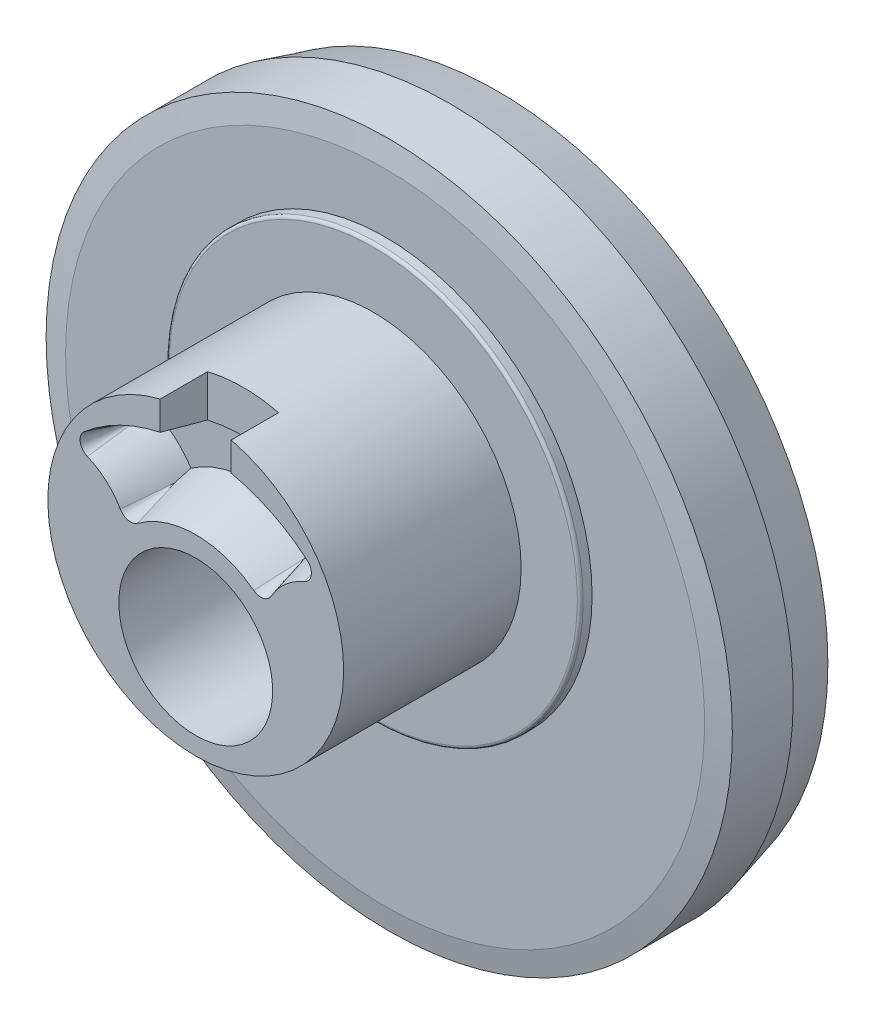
ISO-10303-21;
HEADER;
FILE_DESCRIPTION(('STEP AP214'),'2;1');
FILE_NAME('part.step','',(''),(''),'','','');
FILE_SCHEMA(('AUTOMOTIVE_DESIGN { 1 0 10303 214 1 1 1 1 }'));
ENDSEC;
DATA;
#1=APPLICATION_CONTEXT('core data for automotive mechanical design processes');
#2=APPLICATION_PROTOCOL_DEFINITION('international standard','automotive_design',2000,#1);
#3=PRODUCT_CONTEXT('',#1,'mechanical');
#4=PRODUCT('Part','Part','',(#3));
#5=PRODUCT_RELATED_PRODUCT_CATEGORY('part','',(#4));
#6=PRODUCT_DEFINITION_FORMATION('','',#4);
#7=PRODUCT_DEFINITION_CONTEXT('part definition',#1,'design');
#8=PRODUCT_DEFINITION('design','',#6,#7);
#9=PRODUCT_DEFINITION_SHAPE('','',#8);
#10=(LENGTH_UNIT() NAMED_UNIT(*) SI_UNIT(.MILLI.,.METRE.));
#11=(NAMED_UNIT(*) PLANE_ANGLE_UNIT() SI_UNIT($,.RADIAN.));
#12=(NAMED_UNIT(*) SI_UNIT($,.STERADIAN.) SOLID_ANGLE_UNIT());
#13=UNCERTAINTY_MEASURE_WITH_UNIT(LENGTH_MEASURE(1.E-05),#10,'distance_accuracy_value','');
#14=(GEOMETRIC_REPRESENTATION_CONTEXT(3) GLOBAL_UNCERTAINTY_ASSIGNED_CONTEXT((#13)) GLOBAL_UNIT_ASSIGNED_CONTEXT((#10,
#11,#12)) REPRESENTATION_CONTEXT('',''));
#15=CARTESIAN_POINT('',(0.,0.,0.));
#16=DIRECTION('',(0.,0.,1.));
#17=DIRECTION('',(1.,0.,0.));
#18=AXIS2_PLACEMENT_3D('',#15,#16,#17);
#19=CARTESIAN_POINT('',(0.,4.49999999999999,25.5));
#20=DIRECTION('',(0.,0.,1.));
#21=DIRECTION('',(1.,0.,0.));
#22=AXIS2_PLACEMENT_3D('',#19,#20,#21);
#23=PLANE('',#22);
#24=CARTESIAN_POINT('',(0.,0.,25.5));
#25=DIRECTION('',(0.,0.,-1.));
#26=DIRECTION('',(-1.,0.,0.));
#27=AXIS2_PLACEMENT_3D('',#24,#25,#26);
#28=CIRCLE('',#27,6.5);
#29=CARTESIAN_POINT('',(-6.5,0.,25.5));
#30=VERTEX_POINT('',#29);
#31=EDGE_CURVE('E193',#30,#30,#28,.T.);
#32=ORIENTED_EDGE('',*,*,#31,.T.);
#33=EDGE_LOOP('',(#32));
#34=FACE_BOUND('',#33,.T.);
#35=CARTESIAN_POINT('',(0.,4.49999999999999,25.5));
#36=DIRECTION('',(0.,0.,1.));
#37=DIRECTION('',(1.,0.,0.));
#38=AXIS2_PLACEMENT_3D('',#35,#36,#37);
#39=CIRCLE('',#38,12.5);
#40=CARTESIAN_POINT('',(-3.,16.6346610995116,25.5));
#41=VERTEX_POINT('',#40);
#42=CARTESIAN_POINT('',(3.,16.6346610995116,25.5));
#43=VERTEX_POINT('',#42);
#44=EDGE_CURVE('E191',#41,#43,#39,.T.);
#45=ORIENTED_EDGE('',*,*,#44,.T.);
#46=DIRECTION('',(0.,-1.,0.));
#47=VECTOR('',#46,1.);
#48=CARTESIAN_POINT('',(3.,16.6346610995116,25.5));
#49=LINE('',#48,#47);
#50=CARTESIAN_POINT('',(3.,14.197442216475,25.5));
#51=VERTEX_POINT('',#50);
#52=EDGE_CURVE('E173',#43,#51,#49,.T.);
#53=ORIENTED_EDGE('',*,*,#52,.T.);
#54=CARTESIAN_POINT('',(0.,0.,25.5));
#55=DIRECTION('',(0.,0.,1.));
#56=DIRECTION('',(1.,0.,0.));
#57=AXIS2_PLACEMENT_3D('',#54,#55,#56);
#58=CIRCLE('',#57,14.5109395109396);
#59=CARTESIAN_POINT('',(9.42445258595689,11.0339049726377,25.5));
#60=VERTEX_POINT('',#59);
#61=EDGE_CURVE('E462',#60,#51,#58,.T.);
#62=ORIENTED_EDGE('',*,*,#61,.F.);
#63=CARTESIAN_POINT('',(8.77498033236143,10.2735196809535,25.5));
#64=DIRECTION('',(0.,0.,1.));
#65=DIRECTION('',(-1.,0.,0.));
#66=AXIS2_PLACEMENT_3D('',#63,#64,#65);
#67=CIRCLE('',#66,1.);
#68=CARTESIAN_POINT('',(9.15964616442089,9.35046377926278,25.5));
#69=VERTEX_POINT('',#68);
#70=EDGE_CURVE('E497',#69,#60,#67,.T.);
#71=ORIENTED_EDGE('',*,*,#70,.F.);
#72=CARTESIAN_POINT('',(11.3719776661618,4.04168540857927,25.5));
#73=DIRECTION('',(0.,0.,-1.));
#74=DIRECTION('',(1.,0.,0.));
#75=AXIS2_PLACEMENT_3D('',#72,#73,#74);
#76=CIRCLE('',#75,5.75130754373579);
#77=CARTESIAN_POINT('',(6.37421736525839,6.88772308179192,25.5));
#78=VERTEX_POINT('',#77);
#79=EDGE_CURVE('E477',#78,#69,#76,.T.);
#80=ORIENTED_EDGE('',*,*,#79,.F.);
#81=CARTESIAN_POINT('',(5.50523926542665,7.38257362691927,25.5));
#82=DIRECTION('',(0.,0.,1.));
#83=DIRECTION('',(1.,0.,0.));
#84=AXIS2_PLACEMENT_3D('',#81,#82,#83);
#85=CIRCLE('',#84,1.);
#86=CARTESIAN_POINT('',(4.90744391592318,6.58092487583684,25.5));
#87=VERTEX_POINT('',#86);
#88=EDGE_CURVE('E474',#87,#78,#85,.T.);
#89=ORIENTED_EDGE('',*,*,#88,.F.);
#90=CARTESIAN_POINT('',(0.,0.,25.5));
#91=DIRECTION('',(0.,0.,-1.));
#92=DIRECTION('',(1.,0.,0.));
#93=AXIS2_PLACEMENT_3D('',#90,#91,#92);
#94=CIRCLE('',#93,8.20923735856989);
#95=CARTESIAN_POINT('',(-4.90744391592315,6.58092487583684,25.5));
#96=VERTEX_POINT('',#95);
#97=EDGE_CURVE('E471',#96,#87,#94,.T.);
#98=ORIENTED_EDGE('',*,*,#97,.F.);
#99=CARTESIAN_POINT('',(-5.50523926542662,7.38257362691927,25.5));
#100=DIRECTION('',(0.,0.,1.));
#101=DIRECTION('',(-1.,0.,0.));
#102=AXIS2_PLACEMENT_3D('',#99,#100,#101);
#103=CIRCLE('',#102,1.);
#104=CARTESIAN_POINT('',(-6.37421736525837,6.88772308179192,25.5));
#105=VERTEX_POINT('',#104);
#106=EDGE_CURVE('E464',#105,#96,#103,.T.);
#107=ORIENTED_EDGE('',*,*,#106,.F.);
#108=CARTESIAN_POINT('',(-11.3719776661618,4.04168540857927,25.5));
#109=DIRECTION('',(0.,0.,-1.));
#110=DIRECTION('',(-1.,0.,0.));
#111=AXIS2_PLACEMENT_3D('',#108,#109,#110);
#112=CIRCLE('',#111,5.75130754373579);
#113=CARTESIAN_POINT('',(-9.15964616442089,9.35046377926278,25.5));
#114=VERTEX_POINT('',#113);
#115=EDGE_CURVE('E461',#114,#105,#112,.T.);
#116=ORIENTED_EDGE('',*,*,#115,.F.);
#117=CARTESIAN_POINT('',(-8.77498033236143,10.2735196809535,25.5));
#118=DIRECTION('',(0.,0.,1.));
#119=DIRECTION('',(1.,0.,0.));
#120=AXIS2_PLACEMENT_3D('',#117,#118,#119);
#121=CIRCLE('',#120,1.);
#122=CARTESIAN_POINT('',(-9.42445258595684,11.0339049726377,25.5));
#123=VERTEX_POINT('',#122);
#124=EDGE_CURVE('E456',#123,#114,#121,.T.);
#125=ORIENTED_EDGE('',*,*,#124,.F.);
#126=CARTESIAN_POINT('',(-2.99999999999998,14.197442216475,25.5));
#127=VERTEX_POINT('',#126);
#128=EDGE_CURVE('E459',#127,#123,#58,.T.);
#129=ORIENTED_EDGE('',*,*,#128,.F.);
#130=DIRECTION('',(0.,1.,0.));
#131=VECTOR('',#130,1.);
#132=CARTESIAN_POINT('',(-3.,16.6346610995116,25.5));
#133=LINE('',#132,#131);
#134=EDGE_CURVE('E185',#127,#41,#133,.T.);
#135=ORIENTED_EDGE('',*,*,#134,.T.);
#136=EDGE_LOOP('',(#45,#53,#62,#71,#80,#89,#98,#107,#116,#125,#129,#135));
#137=FACE_BOUND('',#136,.T.);
#138=ADVANCED_FACE('F35',(#34,#137),#23,.T.);
#139=CARTESIAN_POINT('',(0.,4.49999999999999,25.5));
#140=DIRECTION('',(0.,0.,-1.));
#141=DIRECTION('',(-1.,0.,0.));
#142=AXIS2_PLACEMENT_3D('',#139,#140,#141);
#143=CYLINDRICAL_SURFACE('',#142,12.5);
#144=CARTESIAN_POINT('',(0.,4.49999999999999,10.5));
#145=DIRECTION('',(0.,0.,1.));
#146=DIRECTION('',(1.,0.,0.));
#147=AXIS2_PLACEMENT_3D('',#144,#145,#146);
#148=CIRCLE('',#147,12.5);
#149=CARTESIAN_POINT('',(12.5,4.49999999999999,10.5));
#150=VERTEX_POINT('',#149);
#151=EDGE_CURVE('E199',#150,#150,#148,.T.);
#152=ORIENTED_EDGE('',*,*,#151,.T.);
#153=EDGE_LOOP('',(#152));
#154=FACE_BOUND('',#153,.T.);
#155=DIRECTION('',(0.,0.,1.));
#156=VECTOR('',#155,1.);
#157=CARTESIAN_POINT('',(3.,16.6346610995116,21.5));
#158=LINE('',#157,#156);
#159=CARTESIAN_POINT('',(3.,16.6346610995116,21.5));
#160=VERTEX_POINT('',#159);
#161=EDGE_CURVE('E177',#160,#43,#158,.T.);
#162=ORIENTED_EDGE('',*,*,#161,.T.);
#163=ORIENTED_EDGE('',*,*,#44,.F.);
#164=DIRECTION('',(0.,0.,1.));
#165=VECTOR('',#164,1.);
#166=CARTESIAN_POINT('',(-3.,16.6346610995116,21.5));
#167=LINE('',#166,#165);
#168=CARTESIAN_POINT('',(-3.,16.6346610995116,21.5));
#169=VERTEX_POINT('',#168);
#170=EDGE_CURVE('E194',#169,#41,#167,.T.);
#171=ORIENTED_EDGE('',*,*,#170,.F.);
#172=CARTESIAN_POINT('',(0.,4.49999999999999,21.5));
#173=DIRECTION('',(0.,0.,-1.));
#174=DIRECTION('',(-1.,0.,0.));
#175=AXIS2_PLACEMENT_3D('',#172,#173,#174);
#176=CIRCLE('',#175,12.5);
#177=EDGE_CURVE('E192',#169,#160,#176,.T.);
#178=ORIENTED_EDGE('',*,*,#177,.T.);
#179=EDGE_LOOP('',(#162,#163,#171,#178));
#180=FACE_BOUND('',#179,.T.);
#181=ADVANCED_FACE('F189',(#154,#180),#143,.T.);
#182=CARTESIAN_POINT('',(0.,0.,25.5));
#183=DIRECTION('',(0.,0.,1.));
#184=DIRECTION('',(1.,0.,0.));
#185=AXIS2_PLACEMENT_3D('',#182,#183,#184);
#186=CONICAL_SURFACE('',#185,14.5109395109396,0.26179938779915);
#187=CARTESIAN_POINT('',(3.,10.9218173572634,13.614932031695));
#188=CARTESIAN_POINT('',(3.,11.3100454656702,15.012224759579));
#189=CARTESIAN_POINT('',(3.,11.6970071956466,16.4098684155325));
#190=CARTESIAN_POINT('',(3.,12.4689162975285,19.2057100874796));
#191=CARTESIAN_POINT('',(3.,12.853863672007,20.6039081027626));
#192=CARTESIAN_POINT('',(3.,13.6222632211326,23.400713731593));
#193=CARTESIAN_POINT('',(3.00000000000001,14.0057153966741,24.7993213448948));
#194=CARTESIAN_POINT('',(3.,14.7714281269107,27.5968646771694));
#195=CARTESIAN_POINT('',(2.99999999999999,15.1536886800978,28.9958003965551));
#196=CARTESIAN_POINT('',(2.99999999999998,15.5355046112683,30.3948572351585));
#197=B_SPLINE_CURVE_WITH_KNOTS('',3,(#187,#188,#189,#190,#191,#192,#193,#194,#195,#196),
.UNSPECIFIED.,.F.,.F.,(4,2,2,2,4),(0.,4.35066845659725,8.70133135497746,13.0519916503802,
17.4026574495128),.UNSPECIFIED.);
#198=CARTESIAN_POINT('',(3.,13.1000212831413,21.5));
#199=VERTEX_POINT('',#198);
#200=EDGE_CURVE('E180',#199,#51,#197,.T.);
#201=ORIENTED_EDGE('',*,*,#200,.F.);
#202=CARTESIAN_POINT('',(0.,0.,21.5));
#203=DIRECTION('',(0.,0.,-1.));
#204=DIRECTION('',(-1.,0.,0.));
#205=AXIS2_PLACEMENT_3D('',#202,#203,#204);
#206=CIRCLE('',#205,13.4391427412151);
#207=CARTESIAN_POINT('',(-3.,13.1000212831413,21.5));
#208=VERTEX_POINT('',#207);
#209=EDGE_CURVE('E221',#199,#208,#206,.F.);
#210=ORIENTED_EDGE('',*,*,#209,.T.);
#211=CARTESIAN_POINT('',(-3.,15.5355046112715,30.3948572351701));
#212=CARTESIAN_POINT('',(-3.,15.1536886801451,28.9958003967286));
#213=CARTESIAN_POINT('',(-3.,14.7714281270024,27.5968646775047));
#214=CARTESIAN_POINT('',(-3.,14.0057153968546,24.7993213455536));
#215=CARTESIAN_POINT('',(-3.,13.6222632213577,23.4007137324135));
#216=CARTESIAN_POINT('',(-3.,12.853863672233,20.6039081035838));
#217=CARTESIAN_POINT('',(-3.,12.4689162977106,19.2057100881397));
#218=CARTESIAN_POINT('',(-3.00000000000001,11.6970071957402,16.4098684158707));
#219=CARTESIAN_POINT('',(-3.00000000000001,11.3100454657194,15.0122247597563));
#220=CARTESIAN_POINT('',(-3.,10.921817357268,13.6149320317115));
#221=B_SPLINE_CURVE_WITH_KNOTS('',3,(#211,#212,#213,#214,#215,#216,#217,#218,#219,#220),
.UNSPECIFIED.,.F.,.F.,(4,2,2,2,4),(0.,4.35066579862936,8.70132609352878,13.0519889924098,
17.4026574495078),.UNSPECIFIED.);
#222=EDGE_CURVE('E228',#127,#208,#221,.T.);
#223=ORIENTED_EDGE('',*,*,#222,.F.);
#224=ORIENTED_EDGE('',*,*,#128,.T.);
#225=DIRECTION('',(-0.168095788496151,0.196802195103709,0.965925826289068));
#226=VECTOR('',#225,1.);
#227=CARTESIAN_POINT('',(-8.77498033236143,10.2735196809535,21.7679491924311));
#228=LINE('',#227,#226);
#229=CARTESIAN_POINT('',(-8.77498033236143,10.2735196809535,21.7679491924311));
#230=VERTEX_POINT('',#229);
#231=EDGE_CURVE('E311',#230,#123,#228,.T.);
#232=ORIENTED_EDGE('',*,*,#231,.F.);
#233=CARTESIAN_POINT('',(-8.14105916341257,10.3539120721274,20.5));
#234=CARTESIAN_POINT('',(-8.27822543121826,10.3406052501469,20.7773990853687));
#235=CARTESIAN_POINT('',(-8.41611116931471,10.3246391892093,21.0543255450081));
#236=CARTESIAN_POINT('',(-8.69338744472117,10.2869591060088,21.6070514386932));
#237=CARTESIAN_POINT('',(-8.83277807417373,10.2652447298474,21.8828508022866));
#238=CARTESIAN_POINT('',(-9.11273446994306,10.2157070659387,22.4323632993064));
#239=CARTESIAN_POINT('',(-9.25329604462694,10.187900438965,22.7060800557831));
#240=CARTESIAN_POINT('',(-9.53602899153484,10.1256112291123,23.2519156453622));
#241=CARTESIAN_POINT('',(-9.67820033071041,10.0911287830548,23.5240345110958));
#242=CARTESIAN_POINT('',(-9.96439267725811,10.0148016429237,24.0666658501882));
#243=CARTESIAN_POINT('',(-10.1084155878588,9.97294869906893,24.3371761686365));
#244=CARTESIAN_POINT('',(-10.3982239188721,9.88111598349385,24.8758386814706));
#245=CARTESIAN_POINT('',(-10.5440091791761,9.83113694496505,25.1439910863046));
#246=CARTESIAN_POINT('',(-10.8378447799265,9.72191212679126,25.6781418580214));
#247=CARTESIAN_POINT('',(-10.9859001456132,9.66264185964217,25.9441325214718));
#248=CARTESIAN_POINT('',(-11.2094770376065,9.56589834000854,26.3404125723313));
#249=CARTESIAN_POINT('',(-11.2842644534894,9.53233778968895,26.4720770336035));
#250=CARTESIAN_POINT('',(-11.4343477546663,9.46240155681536,26.7343753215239));
#251=CARTESIAN_POINT('',(-11.5096436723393,9.42602569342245,26.8650090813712));
#252=CARTESIAN_POINT('',(-11.5851983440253,9.38814216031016,26.9950624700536));
#253=B_SPLINE_CURVE_WITH_KNOTS('',3,(#233,#234,#235,#236,#237,#238,#239,#240,#241,#242,#243,
#244,#245,#246,#247,#248,#249,#250,#251,#252),.UNSPECIFIED.,.F.,.F.,(4,2,2,2,2,2,2,2,2,4),(0.,
0.929236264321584,1.85852975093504,2.78531288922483,3.71207703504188,4.63988517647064,
5.56760965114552,6.49782162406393,6.96308546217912,7.42837921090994),.UNSPECIFIED.);
#254=CARTESIAN_POINT('',(-8.14105916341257,10.3539120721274,20.5));
#255=VERTEX_POINT('',#254);
#256=EDGE_CURVE('E313',#255,#230,#253,.T.);
#257=ORIENTED_EDGE('',*,*,#256,.F.);
#258=CARTESIAN_POINT('',(0.,0.,20.5));
#259=DIRECTION('',(0.,0.,-1.));
#260=DIRECTION('',(-1.,0.,0.));
#261=AXIS2_PLACEMENT_3D('',#258,#259,#260);
#262=CIRCLE('',#261,13.171193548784);
#263=CARTESIAN_POINT('',(8.14105916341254,10.3539120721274,20.5));
#264=VERTEX_POINT('',#263);
#265=EDGE_CURVE('E480',#264,#255,#262,.F.);
#266=ORIENTED_EDGE('',*,*,#265,.F.);
#267=CARTESIAN_POINT('',(8.14105916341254,10.3539120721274,20.5));
#268=CARTESIAN_POINT('',(8.19345831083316,10.348833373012,20.6059732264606));
#269=CARTESIAN_POINT('',(8.24596278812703,10.3433633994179,20.7118757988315));
#270=CARTESIAN_POINT('',(8.35118241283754,10.331620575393,20.9235245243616));
#271=CARTESIAN_POINT('',(8.4038975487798,10.3253477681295,21.0292706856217));
#272=CARTESIAN_POINT('',(8.50954428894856,10.311978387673,21.2406031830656));
#273=CARTESIAN_POINT('',(8.56247589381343,10.304881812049,21.3461895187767));
#274=CARTESIAN_POINT('',(8.66856135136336,10.2898416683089,21.5571971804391));
#275=CARTESIAN_POINT('',(8.72171521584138,10.2818980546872,21.6626184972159));
#276=CARTESIAN_POINT('',(8.77498033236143,10.2735196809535,21.7679491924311));
#277=B_SPLINE_CURVE_WITH_KNOTS('',3,(#267,#268,#269,#270,#271,#272,#273,#274,#275,#276),
.UNSPECIFIED.,.F.,.F.,(4,2,2,2,4),(0.,0.354986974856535,0.709954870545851,1.06492381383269,
1.41991183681),.UNSPECIFIED.);
#278=CARTESIAN_POINT('',(8.77498033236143,10.2735196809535,21.7679491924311));
#279=VERTEX_POINT('',#278);
#280=EDGE_CURVE('E276',#264,#279,#277,.T.);
#281=ORIENTED_EDGE('',*,*,#280,.T.);
#282=DIRECTION('',(0.168095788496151,0.196802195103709,0.965925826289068));
#283=VECTOR('',#282,1.);
#284=CARTESIAN_POINT('',(8.77498033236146,10.2735196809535,21.7679491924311));
#285=LINE('',#284,#283);
#286=EDGE_CURVE('E314',#279,#60,#285,.T.);
#287=ORIENTED_EDGE('',*,*,#286,.T.);
#288=ORIENTED_EDGE('',*,*,#61,.T.);
#289=EDGE_LOOP('',(#201,#210,#223,#224,#232,#257,#266,#281,#287,#288));
#290=FACE_BOUND('',#289,.T.);
#291=ADVANCED_FACE('F239',(#290),#186,.F.);
#292=CARTESIAN_POINT('',(-12.,0.,0.));
#293=DIRECTION('',(0.,-0.939692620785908,0.342020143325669));
#294=DIRECTION('',(0.,-0.342020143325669,-0.939692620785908));
#295=AXIS2_PLACEMENT_3D('',#292,#293,#294);
#296=PLANE('',#295);
#297=CARTESIAN_POINT('',(0.,18.2106303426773,50.0332956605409));
#298=DIRECTION('',(0.,-0.939692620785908,0.342020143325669));
#299=DIRECTION('',(0.,0.342020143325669,0.939692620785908));
#300=AXIS2_PLACEMENT_3D('',#297,#298,#299);
#301=ELLIPSE('',#300,72.3247114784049,16.7412000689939);
#302=CARTESIAN_POINT('',(-11.7193408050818,0.545955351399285,1.5));
#303=VERTEX_POINT('',#302);
#304=CARTESIAN_POINT('',(-11.9654517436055,0.909925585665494,2.5));
#305=VERTEX_POINT('',#304);
#306=EDGE_CURVE('E58',#303,#305,#301,.F.);
#307=ORIENTED_EDGE('',*,*,#306,.F.);
#308=DIRECTION('',(1.,0.,0.));
#309=VECTOR('',#308,1.);
#310=CARTESIAN_POINT('',(-12.,0.545955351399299,1.5));
#311=LINE('',#310,#309);
#312=CARTESIAN_POINT('',(-11.4410258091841,0.545955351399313,1.5));
#313=VERTEX_POINT('',#312);
#314=EDGE_CURVE('E498',#303,#313,#311,.T.);
#315=ORIENTED_EDGE('',*,*,#314,.T.);
#316=CARTESIAN_POINT('',(-11.052682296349,0.909925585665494,2.5));
#317=CARTESIAN_POINT('',(-11.1346090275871,0.834465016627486,2.29267379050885));
#318=CARTESIAN_POINT('',(-11.2157376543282,0.758903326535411,2.08506975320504));
#319=CARTESIAN_POINT('',(-11.3764754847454,0.607594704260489,1.6693527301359));
#320=CARTESIAN_POINT('',(-11.4560847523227,0.531847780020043,1.46123976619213));
#321=CARTESIAN_POINT('',(-11.6138671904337,0.380179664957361,1.04453504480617));
#322=CARTESIAN_POINT('',(-11.6920403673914,0.304258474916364,0.835943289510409));
#323=CARTESIAN_POINT('',(-11.8470248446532,0.152250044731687,0.418303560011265));
#324=CARTESIAN_POINT('',(-11.9238360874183,0.0761627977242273,0.209255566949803));
#325=CARTESIAN_POINT('',(-12.,0.,0.));
#326=B_SPLINE_CURVE_WITH_KNOTS('',3,(#316,#317,#318,#319,#320,#321,#322,#323,#324,#325),
.UNSPECIFIED.,.F.,.F.,(4,2,2,2,4),(0.,0.706052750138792,1.41207573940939,2.118095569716,
2.82414515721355),.UNSPECIFIED.);
#327=CARTESIAN_POINT('',(-12.,0.,0.));
#328=VERTEX_POINT('',#327);
#329=EDGE_CURVE('E353',#313,#328,#326,.T.);
#330=ORIENTED_EDGE('',*,*,#329,.T.);
#331=DIRECTION('',(-1.,0.,0.));
#332=VECTOR('',#331,1.);
#333=CARTESIAN_POINT('',(-12.,0.,0.));
#334=LINE('',#333,#332);
#335=CARTESIAN_POINT('',(-24.5564648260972,0.,0.));
#336=VERTEX_POINT('',#335);
#337=EDGE_CURVE('E347',#328,#336,#334,.T.);
#338=ORIENTED_EDGE('',*,*,#337,.T.);
#339=DIRECTION('',(0.,-0.342020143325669,-0.939692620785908));
#340=VECTOR('',#339,1.);
#341=CARTESIAN_POINT('',(-24.5564648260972,0.,0.));
#342=LINE('',#341,#340);
#343=CARTESIAN_POINT('',(-24.5564648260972,0.909925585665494,2.5));
#344=VERTEX_POINT('',#343);
#345=EDGE_CURVE('E351',#344,#336,#342,.T.);
#346=ORIENTED_EDGE('',*,*,#345,.F.);
#347=DIRECTION('',(-1.,0.,0.));
#348=VECTOR('',#347,1.);
#349=CARTESIAN_POINT('',(-24.5564648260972,0.909925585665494,2.5));
#350=LINE('',#349,#348);
#351=EDGE_CURVE('E358',#305,#344,#350,.T.);
#352=ORIENTED_EDGE('',*,*,#351,.F.);
#353=EDGE_LOOP('',(#307,#315,#330,#338,#346,#352));
#354=FACE_BOUND('',#353,.T.);
#355=ADVANCED_FACE('F381',(#354),#296,.F.);
#356=CARTESIAN_POINT('',(24.5564648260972,0.,0.));
#357=DIRECTION('',(0.,-0.939692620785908,0.342020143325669));
#358=DIRECTION('',(0.,-0.342020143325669,-0.939692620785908));
#359=AXIS2_PLACEMENT_3D('',#356,#357,#358);
#360=PLANE('',#359);
#361=CARTESIAN_POINT('',(0.,18.2106303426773,50.0332956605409));
#362=DIRECTION('',(0.,-0.939692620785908,0.342020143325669));
#363=DIRECTION('',(0.,0.342020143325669,0.939692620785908));
#364=AXIS2_PLACEMENT_3D('',#361,#362,#363);
#365=ELLIPSE('',#364,72.3247114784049,16.7412000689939);
#366=CARTESIAN_POINT('',(11.9654517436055,0.909925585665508,2.5));
#367=VERTEX_POINT('',#366);
#368=CARTESIAN_POINT('',(11.7193408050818,0.545955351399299,1.5));
#369=VERTEX_POINT('',#368);
#370=EDGE_CURVE('E506',#367,#369,#365,.F.);
#371=ORIENTED_EDGE('',*,*,#370,.F.);
#372=DIRECTION('',(-1.,0.,0.));
#373=VECTOR('',#372,1.);
#374=CARTESIAN_POINT('',(-24.5564648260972,0.909925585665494,2.5));
#375=LINE('',#374,#373);
#376=CARTESIAN_POINT('',(24.5564648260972,0.909925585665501,2.5));
#377=VERTEX_POINT('',#376);
#378=EDGE_CURVE('E552',#377,#367,#375,.T.);
#379=ORIENTED_EDGE('',*,*,#378,.F.);
#380=DIRECTION('',(0.,-0.342020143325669,-0.939692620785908));
#381=VECTOR('',#380,1.);
#382=CARTESIAN_POINT('',(24.5564648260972,0.,0.));
#383=LINE('',#382,#381);
#384=CARTESIAN_POINT('',(24.5564648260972,0.,0.));
#385=VERTEX_POINT('',#384);
#386=EDGE_CURVE('E360',#377,#385,#383,.T.);
#387=ORIENTED_EDGE('',*,*,#386,.T.);
#388=DIRECTION('',(-1.,0.,0.));
#389=VECTOR('',#388,1.);
#390=CARTESIAN_POINT('',(24.5564648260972,0.,0.));
#391=LINE('',#390,#389);
#392=CARTESIAN_POINT('',(12.,0.,0.));
#393=VERTEX_POINT('',#392);
#394=EDGE_CURVE('E341',#385,#393,#391,.T.);
#395=ORIENTED_EDGE('',*,*,#394,.T.);
#396=CARTESIAN_POINT('',(11.0526822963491,0.909925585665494,2.5));
#397=CARTESIAN_POINT('',(11.1346090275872,0.834465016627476,2.29267379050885));
#398=CARTESIAN_POINT('',(11.2157376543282,0.758903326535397,2.08506975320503));
#399=CARTESIAN_POINT('',(11.3764754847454,0.607594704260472,1.66935273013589));
#400=CARTESIAN_POINT('',(11.4560847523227,0.531847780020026,1.46123976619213));
#401=CARTESIAN_POINT('',(11.6138671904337,0.380179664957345,1.04453504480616));
#402=CARTESIAN_POINT('',(11.6920403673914,0.304258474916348,0.835943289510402));
#403=CARTESIAN_POINT('',(11.8470248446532,0.152250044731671,0.418303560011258));
#404=CARTESIAN_POINT('',(11.9238360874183,0.0761627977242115,0.209255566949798));
#405=CARTESIAN_POINT('',(12.,0.,0.));
#406=B_SPLINE_CURVE_WITH_KNOTS('',3,(#396,#397,#398,#399,#400,#401,#402,#403,#404,#405),
.UNSPECIFIED.,.F.,.F.,(4,2,2,2,4),(0.,0.706052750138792,1.41207573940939,2.118095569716,
2.82414515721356),.UNSPECIFIED.);
#407=CARTESIAN_POINT('',(11.4410258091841,0.545955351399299,1.5));
#408=VERTEX_POINT('',#407);
#409=EDGE_CURVE('E362',#408,#393,#406,.T.);
#410=ORIENTED_EDGE('',*,*,#409,.F.);
#411=DIRECTION('',(1.,0.,0.));
#412=VECTOR('',#411,1.);
#413=CARTESIAN_POINT('',(24.5564648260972,0.545955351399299,1.5));
#414=LINE('',#413,#412);
#415=EDGE_CURVE('E218',#408,#369,#414,.T.);
#416=ORIENTED_EDGE('',*,*,#415,.T.);
#417=EDGE_LOOP('',(#371,#379,#387,#395,#410,#416));
#418=FACE_BOUND('',#417,.T.);
#419=ADVANCED_FACE('F377',(#418),#360,.F.);
#420=CARTESIAN_POINT('',(-24.5564648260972,0.999999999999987,2.5));
#421=DIRECTION('',(0.,0.,-1.));
#422=DIRECTION('',(-1.,0.,0.));
#423=AXIS2_PLACEMENT_3D('',#420,#421,#422);
#424=PLANE('',#423);
#425=ORIENTED_EDGE('',*,*,#378,.T.);
#426=CARTESIAN_POINT('',(0.,0.,2.5));
#427=DIRECTION('',(0.,0.,-1.));
#428=DIRECTION('',(-1.,0.,0.));
#429=AXIS2_PLACEMENT_3D('',#426,#427,#428);
#430=CIRCLE('',#429,12.);
#431=EDGE_CURVE('E225',#305,#367,#430,.T.);
#432=ORIENTED_EDGE('',*,*,#431,.F.);
#433=ORIENTED_EDGE('',*,*,#351,.T.);
#434=CARTESIAN_POINT('',(-24.5564648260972,0.999999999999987,2.5));
#435=DIRECTION('',(0.,0.,-1.));
#436=DIRECTION('',(-1.,0.,0.));
#437=AXIS2_PLACEMENT_3D('',#434,#435,#436);
#438=CIRCLE('',#437,0.0900744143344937);
#439=CARTESIAN_POINT('',(-24.6464646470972,1.00366501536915,2.5));
#440=VERTEX_POINT('',#439);
#441=EDGE_CURVE('E350',#344,#440,#438,.T.);
#442=ORIENTED_EDGE('',*,*,#441,.T.);
#443=CARTESIAN_POINT('',(0.,0.,2.5));
#444=DIRECTION('',(0.,0.,-1.));
#445=DIRECTION('',(-1.,0.,0.));
#446=AXIS2_PLACEMENT_3D('',#443,#444,#445);
#447=CIRCLE('',#446,24.6668920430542);
#448=CARTESIAN_POINT('',(24.6464646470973,1.00366501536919,2.5));
#449=VERTEX_POINT('',#448);
#450=EDGE_CURVE('E540',#440,#449,#447,.T.);
#451=ORIENTED_EDGE('',*,*,#450,.T.);
#452=CARTESIAN_POINT('',(24.5564648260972,0.999999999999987,2.5));
#453=DIRECTION('',(0.,0.,-1.));
#454=DIRECTION('',(-1.,0.,0.));
#455=AXIS2_PLACEMENT_3D('',#452,#453,#454);
#456=CIRCLE('',#455,0.0900744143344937);
#457=EDGE_CURVE('E554',#449,#377,#456,.T.);
#458=ORIENTED_EDGE('',*,*,#457,.T.);
#459=EDGE_LOOP('',(#425,#432,#433,#442,#451,#458));
#460=FACE_BOUND('',#459,.T.);
#461=ADVANCED_FACE('F380',(#460),#424,.T.);
#462=CARTESIAN_POINT('',(0.,0.,9.5));
#463=DIRECTION('',(0.,0.,1.));
#464=DIRECTION('',(1.,0.,0.));
#465=AXIS2_PLACEMENT_3D('',#462,#463,#464);
#466=PLANE('',#465);
#467=CARTESIAN_POINT('',(0.,0.,9.5));
#468=DIRECTION('',(0.,0.,1.));
#469=DIRECTION('',(1.,0.,0.));
#470=AXIS2_PLACEMENT_3D('',#467,#468,#469);
#471=CIRCLE('',#470,27.);
#472=CARTESIAN_POINT('',(-27.,0.,9.5));
#473=VERTEX_POINT('',#472);
#474=EDGE_CURVE('E212',#473,#473,#471,.T.);
#475=ORIENTED_EDGE('',*,*,#474,.T.);
#476=EDGE_LOOP('',(#475));
#477=FACE_BOUND('',#476,.T.);
#478=CARTESIAN_POINT('',(0.,4.49999999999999,9.5));
#479=DIRECTION('',(0.,0.,1.));
#480=DIRECTION('',(1.,0.,0.));
#481=AXIS2_PLACEMENT_3D('',#478,#479,#480);
#482=CIRCLE('',#481,17.5);
#483=CARTESIAN_POINT('',(17.5,4.49999999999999,9.5));
#484=VERTEX_POINT('',#483);
#485=EDGE_CURVE('E205',#484,#484,#482,.T.);
#486=ORIENTED_EDGE('',*,*,#485,.F.);
#487=EDGE_LOOP('',(#486));
#488=FACE_BOUND('',#487,.T.);
#489=ADVANCED_FACE('F421',(#477,#488),#466,.T.);
#490=CARTESIAN_POINT('',(0.,0.,9.5));
#491=DIRECTION('',(0.,0.,-1.));
#492=DIRECTION('',(-1.,0.,0.));
#493=AXIS2_PLACEMENT_3D('',#490,#491,#492);
#494=CYLINDRICAL_SURFACE('',#493,29.);
#495=CARTESIAN_POINT('',(0.,0.,4.00000000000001));
#496=DIRECTION('',(0.,0.,1.));
#497=DIRECTION('',(1.,0.,0.));
#498=AXIS2_PLACEMENT_3D('',#495,#496,#497);
#499=CIRCLE('',#498,29.);
#500=CARTESIAN_POINT('',(29.,0.,4.00000000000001));
#501=VERTEX_POINT('',#500);
#502=EDGE_CURVE('E43',#501,#501,#499,.T.);
#503=ORIENTED_EDGE('',*,*,#502,.T.);
#504=EDGE_LOOP('',(#503));
#505=FACE_BOUND('',#504,.T.);
#506=CARTESIAN_POINT('',(0.,0.,9.14734603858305));
#507=DIRECTION('',(0.,0.,1.));
#508=DIRECTION('',(1.,0.,0.));
#509=AXIS2_PLACEMENT_3D('',#506,#507,#508);
#510=CIRCLE('',#509,29.);
#511=CARTESIAN_POINT('',(-29.,0.,9.14734603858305));
#512=VERTEX_POINT('',#511);
#513=EDGE_CURVE('E215',#512,#512,#510,.F.);
#514=ORIENTED_EDGE('',*,*,#513,.T.);
#515=EDGE_LOOP('',(#514));
#516=FACE_BOUND('',#515,.T.);
#517=ADVANCED_FACE('F37',(#505,#516),#494,.T.);
#518=CARTESIAN_POINT('',(0.,0.,0.));
#519=DIRECTION('',(0.,0.,1.));
#520=DIRECTION('',(1.,0.,0.));
#521=AXIS2_PLACEMENT_3D('',#518,#519,#520);
#522=PLANE('',#521);
#523=CARTESIAN_POINT('',(0.,0.,0.));
#524=DIRECTION('',(0.,0.,1.));
#525=DIRECTION('',(1.,0.,0.));
#526=AXIS2_PLACEMENT_3D('',#523,#524,#525);
#527=CIRCLE('',#526,27.9282032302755);
#528=CARTESIAN_POINT('',(27.9282032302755,0.,0.));
#529=VERTEX_POINT('',#528);
#530=EDGE_CURVE('E11',#529,#529,#527,.F.);
#531=ORIENTED_EDGE('',*,*,#530,.T.);
#532=EDGE_LOOP('',(#531));
#533=FACE_BOUND('',#532,.T.);
#534=CARTESIAN_POINT('',(0.,0.,0.));
#535=DIRECTION('',(0.,0.,-1.));
#536=DIRECTION('',(1.,0.,0.));
#537=AXIS2_PLACEMENT_3D('',#534,#535,#536);
#538=CIRCLE('',#537,25.5768176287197);
#539=CARTESIAN_POINT('',(-25.5556366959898,1.04068875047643,0.));
#540=VERTEX_POINT('',#539);
#541=CARTESIAN_POINT('',(25.5556366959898,1.04068875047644,0.));
#542=VERTEX_POINT('',#541);
#543=EDGE_CURVE('E335',#540,#542,#538,.T.);
#544=ORIENTED_EDGE('',*,*,#543,.F.);
#545=CARTESIAN_POINT('',(-24.5564648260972,0.999999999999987,0.));
#546=DIRECTION('',(0.,0.,-1.));
#547=DIRECTION('',(-1.,0.,0.));
#548=AXIS2_PLACEMENT_3D('',#545,#546,#547);
#549=CIRCLE('',#548,1.);
#550=EDGE_CURVE('E333',#336,#540,#549,.T.);
#551=ORIENTED_EDGE('',*,*,#550,.F.);
#552=ORIENTED_EDGE('',*,*,#337,.F.);
#553=CARTESIAN_POINT('',(0.,0.,0.));
#554=DIRECTION('',(0.,0.,-1.));
#555=DIRECTION('',(-1.,0.,0.));
#556=AXIS2_PLACEMENT_3D('',#553,#554,#555);
#557=CIRCLE('',#556,12.);
#558=EDGE_CURVE('E344',#393,#328,#557,.T.);
#559=ORIENTED_EDGE('',*,*,#558,.F.);
#560=ORIENTED_EDGE('',*,*,#394,.F.);
#561=CARTESIAN_POINT('',(24.5564648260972,0.999999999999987,0.));
#562=DIRECTION('',(0.,0.,-1.));
#563=DIRECTION('',(1.,0.,0.));
#564=AXIS2_PLACEMENT_3D('',#561,#562,#563);
#565=CIRCLE('',#564,1.);
#566=EDGE_CURVE('E338',#542,#385,#565,.T.);
#567=ORIENTED_EDGE('',*,*,#566,.F.);
#568=EDGE_LOOP('',(#544,#551,#552,#559,#560,#567));
#569=FACE_BOUND('',#568,.T.);
#570=ADVANCED_FACE('F408',(#533,#569),#522,.F.);
#571=CARTESIAN_POINT('',(0.,4.49999999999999,10.5));
#572=DIRECTION('',(0.,0.,1.));
#573=DIRECTION('',(1.,0.,0.));
#574=AXIS2_PLACEMENT_3D('',#571,#572,#573);
#575=PLANE('',#574);
#576=CARTESIAN_POINT('',(0.,4.49999999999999,10.5));
#577=DIRECTION('',(0.,0.,1.));
#578=DIRECTION('',(1.,0.,0.));
#579=AXIS2_PLACEMENT_3D('',#576,#577,#578);
#580=CIRCLE('',#579,17.25);
#581=CARTESIAN_POINT('',(17.25,4.49999999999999,10.5));
#582=VERTEX_POINT('',#581);
#583=EDGE_CURVE('E198',#582,#582,#580,.T.);
#584=ORIENTED_EDGE('',*,*,#583,.T.);
#585=EDGE_LOOP('',(#584));
#586=FACE_BOUND('',#585,.T.);
#587=ORIENTED_EDGE('',*,*,#151,.F.);
#588=EDGE_LOOP('',(#587));
#589=FACE_BOUND('',#588,.T.);
#590=ADVANCED_FACE('F405',(#586,#589),#575,.T.);
#591=CARTESIAN_POINT('',(0.,4.49999999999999,10.5));
#592=DIRECTION('',(0.,0.,-1.));
#593=DIRECTION('',(-1.,0.,0.));
#594=AXIS2_PLACEMENT_3D('',#591,#592,#593);
#595=CYLINDRICAL_SURFACE('',#594,17.5);
#596=CARTESIAN_POINT('',(0.,4.49999999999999,10.25));
#597=DIRECTION('',(0.,0.,1.));
#598=DIRECTION('',(1.,0.,0.));
#599=AXIS2_PLACEMENT_3D('',#596,#597,#598);
#600=CIRCLE('',#599,17.5);
#601=CARTESIAN_POINT('',(17.5,4.49999999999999,10.25));
#602=VERTEX_POINT('',#601);
#603=EDGE_CURVE('E202',#602,#602,#600,.F.);
#604=ORIENTED_EDGE('',*,*,#603,.T.);
#605=EDGE_LOOP('',(#604));
#606=FACE_BOUND('',#605,.T.);
#607=ORIENTED_EDGE('',*,*,#485,.T.);
#608=EDGE_LOOP('',(#607));
#609=FACE_BOUND('',#608,.T.);
#610=ADVANCED_FACE('F403',(#606,#609),#595,.T.);
#611=CARTESIAN_POINT('',(0.,4.49999999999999,10.25));
#612=DIRECTION('',(0.,0.,1.));
#613=DIRECTION('',(1.,0.,0.));
#614=AXIS2_PLACEMENT_3D('',#611,#612,#613);
#615=TOROIDAL_SURFACE('',#614,17.25,0.25);
#616=ORIENTED_EDGE('',*,*,#603,.F.);
#617=EDGE_LOOP('',(#616));
#618=FACE_BOUND('',#617,.T.);
#619=ORIENTED_EDGE('',*,*,#583,.F.);
#620=EDGE_LOOP('',(#619));
#621=FACE_BOUND('',#620,.T.);
#622=ADVANCED_FACE('F390',(#618,#621),#615,.T.);
#623=CARTESIAN_POINT('',(-24.5564648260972,0.999999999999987,0.));
#624=DIRECTION('',(0.,0.,-1.));
#625=DIRECTION('',(-1.,0.,0.));
#626=AXIS2_PLACEMENT_3D('',#623,#624,#625);
#627=CONICAL_SURFACE('',#626,1.,0.349065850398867);
#628=ORIENTED_EDGE('',*,*,#550,.T.);
#629=DIRECTION('',(-0.341736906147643,0.0139163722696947,-0.939692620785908));
#630=VECTOR('',#629,1.);
#631=CARTESIAN_POINT('',(-25.5556366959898,1.04068875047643,0.));
#632=LINE('',#631,#630);
#633=EDGE_CURVE('E354',#440,#540,#632,.T.);
#634=ORIENTED_EDGE('',*,*,#633,.F.);
#635=ORIENTED_EDGE('',*,*,#441,.F.);
#636=ORIENTED_EDGE('',*,*,#345,.T.);
#637=EDGE_LOOP('',(#628,#634,#635,#636));
#638=FACE_BOUND('',#637,.T.);
#639=ADVANCED_FACE('F387',(#638),#627,.F.);
#640=CARTESIAN_POINT('',(0.,0.,0.));
#641=DIRECTION('',(0.,0.,-1.));
#642=DIRECTION('',(-1.,0.,0.));
#643=AXIS2_PLACEMENT_3D('',#640,#641,#642);
#644=CONICAL_SURFACE('',#643,12.,0.349065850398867);
#645=ORIENTED_EDGE('',*,*,#329,.F.);
#646=CARTESIAN_POINT('',(0.,0.,1.5));
#647=DIRECTION('',(0.,0.,-1.));
#648=DIRECTION('',(-1.,0.,0.));
#649=AXIS2_PLACEMENT_3D('',#646,#647,#648);
#650=CIRCLE('',#649,11.4540446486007);
#651=EDGE_CURVE('E500',#313,#408,#650,.F.);
#652=ORIENTED_EDGE('',*,*,#651,.T.);
#653=ORIENTED_EDGE('',*,*,#409,.T.);
#654=ORIENTED_EDGE('',*,*,#558,.T.);
#655=EDGE_LOOP('',(#645,#652,#653,#654));
#656=FACE_BOUND('',#655,.T.);
#657=ADVANCED_FACE('F374',(#656),#644,.F.);
#658=CARTESIAN_POINT('',(24.5564648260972,0.999999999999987,0.));
#659=DIRECTION('',(0.,0.,-1.));
#660=DIRECTION('',(1.,0.,0.));
#661=AXIS2_PLACEMENT_3D('',#658,#659,#660);
#662=CONICAL_SURFACE('',#661,1.,0.349065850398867);
#663=ORIENTED_EDGE('',*,*,#566,.T.);
#664=ORIENTED_EDGE('',*,*,#386,.F.);
#665=ORIENTED_EDGE('',*,*,#457,.F.);
#666=DIRECTION('',(0.341736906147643,0.0139163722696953,-0.939692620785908));
#667=VECTOR('',#666,1.);
#668=CARTESIAN_POINT('',(25.5556366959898,1.04068875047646,0.));
#669=LINE('',#668,#667);
#670=EDGE_CURVE('E357',#449,#542,#669,.T.);
#671=ORIENTED_EDGE('',*,*,#670,.T.);
#672=EDGE_LOOP('',(#663,#664,#665,#671));
#673=FACE_BOUND('',#672,.T.);
#674=ADVANCED_FACE('F396',(#673),#662,.F.);
#675=CARTESIAN_POINT('',(0.,0.,0.));
#676=DIRECTION('',(0.,0.,-1.));
#677=DIRECTION('',(1.,0.,0.));
#678=AXIS2_PLACEMENT_3D('',#675,#676,#677);
#679=CONICAL_SURFACE('',#678,25.5768176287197,0.349065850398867);
#680=ORIENTED_EDGE('',*,*,#543,.T.);
#681=ORIENTED_EDGE('',*,*,#670,.F.);
#682=ORIENTED_EDGE('',*,*,#450,.F.);
#683=ORIENTED_EDGE('',*,*,#633,.T.);
#684=EDGE_LOOP('',(#680,#681,#682,#683));
#685=FACE_BOUND('',#684,.T.);
#686=ADVANCED_FACE('F392',(#685),#679,.F.);
#687=CARTESIAN_POINT('',(0.,0.,9.5));
#688=DIRECTION('',(0.,0.,-1.));
#689=DIRECTION('',(-1.,0.,0.));
#690=AXIS2_PLACEMENT_3D('',#687,#688,#689);
#691=CONICAL_SURFACE('',#690,27.,1.39626340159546);
#692=CARTESIAN_POINT('',(-29.,0.,9.14734603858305));
#693=CARTESIAN_POINT('',(-28.9791666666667,0.,9.15101951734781));
#694=CARTESIAN_POINT('',(-28.9583333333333,0.,9.15469299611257));
#695=CARTESIAN_POINT('',(-28.9166666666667,0.,9.16203995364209));
#696=CARTESIAN_POINT('',(-28.8958333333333,0.,9.16571343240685));
#697=CARTESIAN_POINT('',(-28.8541666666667,0.,9.17306038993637));
#698=CARTESIAN_POINT('',(-28.8333333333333,0.,9.17673386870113));
#699=CARTESIAN_POINT('',(-28.7916666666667,0.,9.18408082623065));
#700=CARTESIAN_POINT('',(-28.7708333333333,0.,9.18775430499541));
#701=CARTESIAN_POINT('',(-28.7291666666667,0.,9.19510126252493));
#702=CARTESIAN_POINT('',(-28.7083333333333,0.,9.19877474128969));
#703=CARTESIAN_POINT('',(-28.6666666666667,0.,9.20612169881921));
#704=CARTESIAN_POINT('',(-28.6458333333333,0.,9.20979517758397));
#705=CARTESIAN_POINT('',(-28.6041666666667,0.,9.21714213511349));
#706=CARTESIAN_POINT('',(-28.5833333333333,0.,9.22081561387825));
#707=CARTESIAN_POINT('',(-28.5416666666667,0.,9.22816257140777));
#708=CARTESIAN_POINT('',(-28.5208333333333,0.,9.23183605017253));
#709=CARTESIAN_POINT('',(-28.4791666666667,0.,9.23918300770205));
#710=CARTESIAN_POINT('',(-28.4583333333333,0.,9.24285648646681));
#711=CARTESIAN_POINT('',(-28.4166666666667,0.,9.25020344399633));
#712=CARTESIAN_POINT('',(-28.3958333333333,0.,9.25387692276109));
#713=CARTESIAN_POINT('',(-28.3541666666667,0.,9.26122388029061));
#714=CARTESIAN_POINT('',(-28.3333333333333,0.,9.26489735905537));
#715=CARTESIAN_POINT('',(-28.2916666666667,0.,9.27224431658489));
#716=CARTESIAN_POINT('',(-28.2708333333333,0.,9.27591779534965));
#717=CARTESIAN_POINT('',(-28.2291666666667,0.,9.28326475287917));
#718=CARTESIAN_POINT('',(-28.2083333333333,0.,9.28693823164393));
#719=CARTESIAN_POINT('',(-28.1666666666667,0.,9.29428518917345));
#720=CARTESIAN_POINT('',(-28.1458333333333,0.,9.29795866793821));
#721=CARTESIAN_POINT('',(-28.1041666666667,0.,9.30530562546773));
#722=CARTESIAN_POINT('',(-28.0833333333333,0.,9.30897910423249));
#723=CARTESIAN_POINT('',(-28.0416666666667,0.,9.31632606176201));
#724=CARTESIAN_POINT('',(-28.0208333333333,0.,9.31999954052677));
#725=CARTESIAN_POINT('',(-27.9791666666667,0.,9.32734649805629));
#726=CARTESIAN_POINT('',(-27.9583333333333,0.,9.33101997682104));
#727=CARTESIAN_POINT('',(-27.9166666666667,0.,9.33836693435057));
#728=CARTESIAN_POINT('',(-27.8958333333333,0.,9.34204041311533));
#729=CARTESIAN_POINT('',(-27.8541666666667,0.,9.34938737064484));
#730=CARTESIAN_POINT('',(-27.8333333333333,0.,9.35306084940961));
#731=CARTESIAN_POINT('',(-27.7916666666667,0.,9.36040780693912));
#732=CARTESIAN_POINT('',(-27.7708333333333,0.,9.36408128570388));
#733=CARTESIAN_POINT('',(-27.7291666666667,0.,9.3714282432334));
#734=CARTESIAN_POINT('',(-27.7083333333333,0.,9.37510172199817));
#735=CARTESIAN_POINT('',(-27.6666666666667,0.,9.38244867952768));
#736=CARTESIAN_POINT('',(-27.6458333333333,0.,9.38612215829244));
#737=CARTESIAN_POINT('',(-27.6041666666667,0.,9.39346911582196));
#738=CARTESIAN_POINT('',(-27.5833333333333,0.,9.39714259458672));
#739=CARTESIAN_POINT('',(-27.5416666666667,0.,9.40448955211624));
#740=CARTESIAN_POINT('',(-27.5208333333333,0.,9.408163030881));
#741=CARTESIAN_POINT('',(-27.4791666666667,0.,9.41550998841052));
#742=CARTESIAN_POINT('',(-27.4583333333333,0.,9.41918346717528));
#743=CARTESIAN_POINT('',(-27.4166666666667,0.,9.4265304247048));
#744=CARTESIAN_POINT('',(-27.3958333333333,0.,9.43020390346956));
#745=CARTESIAN_POINT('',(-27.3541666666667,0.,9.43755086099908));
#746=CARTESIAN_POINT('',(-27.3333333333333,0.,9.44122433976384));
#747=CARTESIAN_POINT('',(-27.2916666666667,0.,9.44857129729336));
#748=CARTESIAN_POINT('',(-27.2708333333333,0.,9.45224477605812));
#749=CARTESIAN_POINT('',(-27.2291666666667,0.,9.45959173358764));
#750=CARTESIAN_POINT('',(-27.2083333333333,0.,9.4632652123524));
#751=CARTESIAN_POINT('',(-27.1666666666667,0.,9.47061216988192));
#752=CARTESIAN_POINT('',(-27.1458333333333,0.,9.47428564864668));
#753=CARTESIAN_POINT('',(-27.1041666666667,0.,9.4816326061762));
#754=CARTESIAN_POINT('',(-27.0833333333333,0.,9.48530608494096));
#755=CARTESIAN_POINT('',(-27.0416666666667,0.,9.49265304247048));
#756=CARTESIAN_POINT('',(-27.0208333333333,0.,9.49632652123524));
#757=CARTESIAN_POINT('',(-27.,0.,9.5));
#758=B_SPLINE_CURVE_WITH_KNOTS('',3,(#692,#693,#694,#695,#696,#697,#698,#699,#700,#701,#702,
#703,#704,#705,#706,#707,#708,#709,#710,#711,#712,#713,#714,#715,#716,#717,#718,#719,#720,#721,
#722,#723,#724,#725,#726,#727,#728,#729,#730,#731,#732,#733,#734,#735,#736,#737,#738,#739,#740,
#741,#742,#743,#744,#745,#746,#747,#748,#749,#750,#751,#752,#753,#754,#755,#756,#757),
.UNSPECIFIED.,.F.,.F.,(4,2,2,2,2,2,2,2,2,2,2,2,2,2,2,2,2,2,2,2,2,2,2,2,2,2,2,2,2,2,2,2,4),(0.,
0.0634641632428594,0.126928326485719,0.190392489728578,0.253856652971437,0.317320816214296,
0.380784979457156,0.444249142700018,0.507713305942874,0.571177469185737,0.634641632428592,
0.698105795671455,0.761569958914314,0.825034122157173,0.888498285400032,0.951962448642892,
1.01542661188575,1.07889077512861,1.14235493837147,1.20581910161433,1.26928326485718,
1.33274742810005,1.39621159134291,1.45967575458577,1.52313991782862,1.58660408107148,
1.65006824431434,1.7135324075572,1.77699657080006,1.84046073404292,1.90392489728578,
1.96738906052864,2.0308532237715),.UNSPECIFIED.);
#759=EDGE_CURVE('BSEAM395',#512,#473,#758,.T.);
#760=ORIENTED_EDGE('',*,*,#513,.F.);
#761=ORIENTED_EDGE('',*,*,#474,.F.);
#762=ORIENTED_EDGE('',*,*,#759,.T.);
#763=ORIENTED_EDGE('',*,*,#759,.F.);
#764=EDGE_LOOP('',(#760,#762,#761,#763));
#765=FACE_BOUND('',#764,.T.);
#766=ADVANCED_FACE('F395',(#765),#691,.T.);
#767=CARTESIAN_POINT('',(8.77498033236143,10.2735196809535,25.5));
#768=DIRECTION('',(0.,0.,1.));
#769=DIRECTION('',(-1.,0.,0.));
#770=AXIS2_PLACEMENT_3D('',#767,#768,#769);
#771=CONICAL_SURFACE('',#770,1.,0.26179938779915);
#772=DIRECTION('',(-0.0995588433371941,0.238904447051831,-0.965925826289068));
#773=VECTOR('',#772,1.);
#774=CARTESIAN_POINT('',(10.0734789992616,7.15760254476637,34.3660605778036));
#775=LINE('',#774,#773);
#776=EDGE_CURVE('E332',#279,#69,#775,.F.);
#777=ORIENTED_EDGE('',*,*,#776,.T.);
#778=ORIENTED_EDGE('',*,*,#70,.T.);
#779=ORIENTED_EDGE('',*,*,#286,.F.);
#780=EDGE_LOOP('',(#777,#778,#779));
#781=FACE_BOUND('',#780,.T.);
#782=ADVANCED_FACE('F272',(#781),#771,.F.);
#783=CARTESIAN_POINT('',(11.3719776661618,4.04168540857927,25.5));
#784=DIRECTION('',(0.,0.,-1.));
#785=DIRECTION('',(1.,0.,0.));
#786=AXIS2_PLACEMENT_3D('',#783,#784,#785);
#787=CONICAL_SURFACE('',#786,5.75130754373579,0.26179938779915);
#788=ORIENTED_EDGE('',*,*,#79,.T.);
#789=ORIENTED_EDGE('',*,*,#776,.F.);
#790=ORIENTED_EDGE('',*,*,#280,.F.);
#791=CARTESIAN_POINT('',(11.3719776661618,4.04168540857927,20.5));
#792=DIRECTION('',(0.,0.,-1.));
#793=DIRECTION('',(-1.,0.,0.));
#794=AXIS2_PLACEMENT_3D('',#791,#792,#793);
#795=CIRCLE('',#794,7.09105350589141);
#796=CARTESIAN_POINT('',(5.40461732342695,7.87230551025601,20.5));
#797=VERTEX_POINT('',#796);
#798=EDGE_CURVE('E482',#797,#264,#795,.T.);
#799=ORIENTED_EDGE('',*,*,#798,.F.);
#800=CARTESIAN_POINT('',(5.40461732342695,7.87230551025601,20.5));
#801=CARTESIAN_POINT('',(5.41269358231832,7.83230870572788,20.6059997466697));
#802=CARTESIAN_POINT('',(5.42084064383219,7.79212503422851,20.7119237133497));
#803=CARTESIAN_POINT('',(5.43728570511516,7.71136000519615,20.9236059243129));
#804=CARTESIAN_POINT('',(5.44558370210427,7.67077865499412,21.0293641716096));
#805=CARTESIAN_POINT('',(5.462340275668,7.58919278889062,21.2407048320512));
#806=CARTESIAN_POINT('',(5.47079885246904,7.54818827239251,21.3462872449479));
#807=CARTESIAN_POINT('',(5.4878876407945,7.46572702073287,21.5572636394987));
#808=CARTESIAN_POINT('',(5.49651785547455,7.42427027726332,21.6626576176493));
#809=CARTESIAN_POINT('',(5.50523926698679,7.38257361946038,21.7679492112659));
#810=B_SPLINE_CURVE_WITH_KNOTS('',3,(#800,#801,#802,#803,#804,#805,#806,#807,#808,#809),
.UNSPECIFIED.,.F.,.F.,(4,2,2,2,4),(0.,0.340746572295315,0.681486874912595,1.02222765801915,
1.36297471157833),.UNSPECIFIED.);
#811=CARTESIAN_POINT('',(5.50523926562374,7.38257362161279,21.7679492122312));
#812=VERTEX_POINT('',#811);
#813=EDGE_CURVE('E283',#797,#812,#810,.T.);
#814=ORIENTED_EDGE('',*,*,#813,.T.);
#815=DIRECTION('',(0.224908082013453,-0.128076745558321,0.965925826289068));
#816=VECTOR('',#815,1.);
#817=CARTESIAN_POINT('',(8.43860846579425,5.71212951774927,34.3660605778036));
#818=LINE('',#817,#816);
#819=EDGE_CURVE('E290',#812,#78,#818,.T.);
#820=ORIENTED_EDGE('',*,*,#819,.T.);
#821=EDGE_LOOP('',(#788,#789,#790,#799,#814,#820));
#822=FACE_BOUND('',#821,.T.);
#823=ADVANCED_FACE('F268',(#822),#787,.T.);
#824=CARTESIAN_POINT('',(5.50523926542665,7.38257362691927,25.5));
#825=DIRECTION('',(0.,0.,1.));
#826=DIRECTION('',(1.,0.,0.));
#827=AXIS2_PLACEMENT_3D('',#824,#825,#826);
#828=CONICAL_SURFACE('',#827,1.,0.26179938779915);
#829=DIRECTION('',(0.154720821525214,0.207481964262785,-0.965925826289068));
#830=VECTOR('',#829,1.);
#831=CARTESIAN_POINT('',(2.75261963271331,3.69128681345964,38.9526200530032));
#832=LINE('',#831,#830);
#833=EDGE_CURVE('E291',#812,#87,#832,.F.);
#834=ORIENTED_EDGE('',*,*,#833,.T.);
#835=ORIENTED_EDGE('',*,*,#88,.T.);
#836=ORIENTED_EDGE('',*,*,#819,.F.);
#837=EDGE_LOOP('',(#834,#835,#836));
#838=FACE_BOUND('',#837,.T.);
#839=ADVANCED_FACE('F271',(#838),#828,.F.);
#840=CARTESIAN_POINT('',(0.,0.,25.5));
#841=DIRECTION('',(0.,0.,-1.));
#842=DIRECTION('',(1.,0.,0.));
#843=AXIS2_PLACEMENT_3D('',#840,#841,#842);
#844=CONICAL_SURFACE('',#843,8.20923735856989,0.26179938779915);
#845=ORIENTED_EDGE('',*,*,#97,.T.);
#846=ORIENTED_EDGE('',*,*,#833,.F.);
#847=ORIENTED_EDGE('',*,*,#813,.F.);
#848=CARTESIAN_POINT('',(0.,0.,20.5));
#849=DIRECTION('',(0.,0.,-1.));
#850=DIRECTION('',(-1.,0.,0.));
#851=AXIS2_PLACEMENT_3D('',#848,#849,#850);
#852=CIRCLE('',#851,9.54898332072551);
#853=CARTESIAN_POINT('',(-5.40461732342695,7.87230551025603,20.5));
#854=VERTEX_POINT('',#853);
#855=EDGE_CURVE('E485',#854,#797,#852,.T.);
#856=ORIENTED_EDGE('',*,*,#855,.F.);
#857=CARTESIAN_POINT('',(-5.40461732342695,7.87230551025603,20.5));
#858=CARTESIAN_POINT('',(-5.41269358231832,7.83230870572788,20.6059997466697));
#859=CARTESIAN_POINT('',(-5.42084064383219,7.79212503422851,20.7119237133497));
#860=CARTESIAN_POINT('',(-5.43728570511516,7.71136000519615,20.9236059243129));
#861=CARTESIAN_POINT('',(-5.44558370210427,7.67077865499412,21.0293641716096));
#862=CARTESIAN_POINT('',(-5.462340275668,7.58919278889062,21.2407048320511));
#863=CARTESIAN_POINT('',(-5.47079885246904,7.54818827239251,21.3462872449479));
#864=CARTESIAN_POINT('',(-5.4878876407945,7.46572702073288,21.5572636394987));
#865=CARTESIAN_POINT('',(-5.49651785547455,7.42427027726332,21.6626576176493));
#866=CARTESIAN_POINT('',(-5.50523926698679,7.38257361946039,21.7679492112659));
#867=B_SPLINE_CURVE_WITH_KNOTS('',3,(#857,#858,#859,#860,#861,#862,#863,#864,#865,#866),
.UNSPECIFIED.,.F.,.F.,(4,2,2,2,4),(0.,0.34074657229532,0.681486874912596,1.02222765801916,
1.36297471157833),.UNSPECIFIED.);
#868=CARTESIAN_POINT('',(-5.50523926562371,7.38257362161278,21.7679492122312));
#869=VERTEX_POINT('',#868);
#870=EDGE_CURVE('E305',#854,#869,#867,.T.);
#871=ORIENTED_EDGE('',*,*,#870,.T.);
#872=DIRECTION('',(0.154720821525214,-0.207481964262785,0.965925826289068));
#873=VECTOR('',#872,1.);
#874=CARTESIAN_POINT('',(-2.75261963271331,3.69128681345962,38.9526200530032));
#875=LINE('',#874,#873);
#876=EDGE_CURVE('E310',#869,#96,#875,.T.);
#877=ORIENTED_EDGE('',*,*,#876,.T.);
#878=EDGE_LOOP('',(#845,#846,#847,#856,#871,#877));
#879=FACE_BOUND('',#878,.T.);
#880=ADVANCED_FACE('F295',(#879),#844,.T.);
#881=CARTESIAN_POINT('',(-5.50523926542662,7.38257362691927,25.5));
#882=DIRECTION('',(0.,0.,1.));
#883=DIRECTION('',(-1.,0.,0.));
#884=AXIS2_PLACEMENT_3D('',#881,#882,#883);
#885=CONICAL_SURFACE('',#884,1.,0.26179938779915);
#886=DIRECTION('',(0.224908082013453,0.128076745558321,-0.965925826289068));
#887=VECTOR('',#886,1.);
#888=CARTESIAN_POINT('',(-8.43860846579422,5.71212951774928,34.3660605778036));
#889=LINE('',#888,#887);
#890=EDGE_CURVE('E292',#869,#105,#889,.F.);
#891=ORIENTED_EDGE('',*,*,#890,.T.);
#892=ORIENTED_EDGE('',*,*,#106,.T.);
#893=ORIENTED_EDGE('',*,*,#876,.F.);
#894=EDGE_LOOP('',(#891,#892,#893));
#895=FACE_BOUND('',#894,.T.);
#896=ADVANCED_FACE('F299',(#895),#885,.F.);
#897=CARTESIAN_POINT('',(-11.3719776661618,4.04168540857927,25.5));
#898=DIRECTION('',(0.,0.,-1.));
#899=DIRECTION('',(-1.,0.,0.));
#900=AXIS2_PLACEMENT_3D('',#897,#898,#899);
#901=CONICAL_SURFACE('',#900,5.75130754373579,0.26179938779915);
#902=ORIENTED_EDGE('',*,*,#115,.T.);
#903=ORIENTED_EDGE('',*,*,#890,.F.);
#904=ORIENTED_EDGE('',*,*,#870,.F.);
#905=CARTESIAN_POINT('',(-11.3719776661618,4.04168540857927,20.5));
#906=DIRECTION('',(0.,0.,-1.));
#907=DIRECTION('',(-1.,0.,0.));
#908=AXIS2_PLACEMENT_3D('',#905,#906,#907);
#909=CIRCLE('',#908,7.09105350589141);
#910=EDGE_CURVE('E328',#255,#854,#909,.T.);
#911=ORIENTED_EDGE('',*,*,#910,.F.);
#912=ORIENTED_EDGE('',*,*,#256,.T.);
#913=DIRECTION('',(-0.0995588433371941,-0.238904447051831,0.965925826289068));
#914=VECTOR('',#913,1.);
#915=CARTESIAN_POINT('',(-10.0734789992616,7.15760254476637,34.3660605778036));
#916=LINE('',#915,#914);
#917=EDGE_CURVE('E318',#230,#114,#916,.T.);
#918=ORIENTED_EDGE('',*,*,#917,.T.);
#919=EDGE_LOOP('',(#902,#903,#904,#911,#912,#918));
#920=FACE_BOUND('',#919,.T.);
#921=ADVANCED_FACE('F301',(#920),#901,.T.);
#922=CARTESIAN_POINT('',(-8.77498033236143,10.2735196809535,25.5));
#923=DIRECTION('',(0.,0.,1.));
#924=DIRECTION('',(1.,0.,0.));
#925=AXIS2_PLACEMENT_3D('',#922,#923,#924);
#926=CONICAL_SURFACE('',#925,1.,0.26179938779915);
#927=ORIENTED_EDGE('',*,*,#231,.T.);
#928=ORIENTED_EDGE('',*,*,#124,.T.);
#929=ORIENTED_EDGE('',*,*,#917,.F.);
#930=EDGE_LOOP('',(#927,#928,#929));
#931=FACE_BOUND('',#930,.T.);
#932=ADVANCED_FACE('F266',(#931),#926,.F.);
#933=CARTESIAN_POINT('',(10.0734789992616,7.15760254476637,20.5));
#934=DIRECTION('',(0.,0.,-1.));
#935=DIRECTION('',(-1.,0.,0.));
#936=AXIS2_PLACEMENT_3D('',#933,#934,#935);
#937=PLANE('',#936);
#938=ORIENTED_EDGE('',*,*,#265,.T.);
#939=ORIENTED_EDGE('',*,*,#910,.T.);
#940=ORIENTED_EDGE('',*,*,#855,.T.);
#941=ORIENTED_EDGE('',*,*,#798,.T.);
#942=EDGE_LOOP('',(#938,#939,#940,#941));
#943=FACE_BOUND('',#942,.T.);
#944=ADVANCED_FACE('F261',(#943),#937,.F.);
#945=CARTESIAN_POINT('',(0.,0.,1.5));
#946=DIRECTION('',(0.,0.,-1.));
#947=DIRECTION('',(-1.,0.,0.));
#948=AXIS2_PLACEMENT_3D('',#945,#946,#947);
#949=PLANE('',#948);
#950=CARTESIAN_POINT('',(0.,0.,1.5));
#951=DIRECTION('',(0.,0.,-1.));
#952=DIRECTION('',(-1.,0.,0.));
#953=AXIS2_PLACEMENT_3D('',#950,#951,#952);
#954=CIRCLE('',#953,6.5);
#955=CARTESIAN_POINT('',(-6.5,0.,1.5));
#956=VERTEX_POINT('',#955);
#957=EDGE_CURVE('E222',#956,#956,#954,.T.);
#958=ORIENTED_EDGE('',*,*,#957,.F.);
#959=EDGE_LOOP('',(#958));
#960=FACE_BOUND('',#959,.T.);
#961=ORIENTED_EDGE('',*,*,#314,.F.);
#962=CARTESIAN_POINT('',(0.,0.,1.5));
#963=DIRECTION('',(0.,0.,-1.));
#964=DIRECTION('',(-1.,0.,0.));
#965=AXIS2_PLACEMENT_3D('',#962,#963,#964);
#966=CIRCLE('',#965,11.7320508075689);
#967=EDGE_CURVE('E508',#303,#369,#966,.T.);
#968=ORIENTED_EDGE('',*,*,#967,.T.);
#969=ORIENTED_EDGE('',*,*,#415,.F.);
#970=ORIENTED_EDGE('',*,*,#651,.F.);
#971=EDGE_LOOP('',(#961,#968,#969,#970));
#972=FACE_BOUND('',#971,.T.);
#973=ADVANCED_FACE('F258',(#960,#972),#949,.T.);
#974=CARTESIAN_POINT('',(0.,0.,2.5));
#975=DIRECTION('',(0.,0.,1.));
#976=DIRECTION('',(-1.,0.,0.));
#977=AXIS2_PLACEMENT_3D('',#974,#975,#976);
#978=CONICAL_SURFACE('',#977,12.,0.26179938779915);
#979=ORIENTED_EDGE('',*,*,#967,.F.);
#980=ORIENTED_EDGE('',*,*,#306,.T.);
#981=ORIENTED_EDGE('',*,*,#431,.T.);
#982=ORIENTED_EDGE('',*,*,#370,.T.);
#983=EDGE_LOOP('',(#979,#980,#981,#982));
#984=FACE_BOUND('',#983,.T.);
#985=ADVANCED_FACE('F256',(#984),#978,.T.);
#986=CARTESIAN_POINT('',(0.,0.,25.5));
#987=DIRECTION('',(0.,0.,-1.));
#988=DIRECTION('',(-1.,0.,0.));
#989=AXIS2_PLACEMENT_3D('',#986,#987,#988);
#990=CYLINDRICAL_SURFACE('',#989,6.5);
#991=ORIENTED_EDGE('',*,*,#957,.T.);
#992=EDGE_LOOP('',(#991));
#993=FACE_BOUND('',#992,.T.);
#994=ORIENTED_EDGE('',*,*,#31,.F.);
#995=EDGE_LOOP('',(#994));
#996=FACE_BOUND('',#995,.T.);
#997=ADVANCED_FACE('F253',(#993,#996),#990,.F.);
#998=CARTESIAN_POINT('',(3.,16.6346610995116,21.5));
#999=DIRECTION('',(-1.,0.,0.));
#1000=DIRECTION('',(0.,-1.,0.));
#1001=AXIS2_PLACEMENT_3D('',#998,#999,#1000);
#1002=PLANE('',#1001);
#1003=ORIENTED_EDGE('',*,*,#200,.T.);
#1004=ORIENTED_EDGE('',*,*,#52,.F.);
#1005=ORIENTED_EDGE('',*,*,#161,.F.);
#1006=DIRECTION('',(0.,-1.,0.));
#1007=VECTOR('',#1006,1.);
#1008=CARTESIAN_POINT('',(3.,16.6346610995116,21.5));
#1009=LINE('',#1008,#1007);
#1010=EDGE_CURVE('E516',#160,#199,#1009,.T.);
#1011=ORIENTED_EDGE('',*,*,#1010,.T.);
#1012=EDGE_LOOP('',(#1003,#1004,#1005,#1011));
#1013=FACE_BOUND('',#1012,.T.);
#1014=ADVANCED_FACE('F175',(#1013),#1002,.T.);
#1015=CARTESIAN_POINT('',(-3.,16.6346610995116,21.5));
#1016=DIRECTION('',(1.,0.,0.));
#1017=DIRECTION('',(0.,1.,0.));
#1018=AXIS2_PLACEMENT_3D('',#1015,#1016,#1017);
#1019=PLANE('',#1018);
#1020=ORIENTED_EDGE('',*,*,#222,.T.);
#1021=DIRECTION('',(0.,1.,0.));
#1022=VECTOR('',#1021,1.);
#1023=CARTESIAN_POINT('',(-3.,16.6346610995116,21.5));
#1024=LINE('',#1023,#1022);
#1025=EDGE_CURVE('E50',#208,#169,#1024,.T.);
#1026=ORIENTED_EDGE('',*,*,#1025,.T.);
#1027=ORIENTED_EDGE('',*,*,#170,.T.);
#1028=ORIENTED_EDGE('',*,*,#134,.F.);
#1029=EDGE_LOOP('',(#1020,#1026,#1027,#1028));
#1030=FACE_BOUND('',#1029,.T.);
#1031=ADVANCED_FACE('F243',(#1030),#1019,.T.);
#1032=CARTESIAN_POINT('',(0.,4.49999999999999,21.5));
#1033=DIRECTION('',(0.,0.,-1.));
#1034=DIRECTION('',(-1.,0.,0.));
#1035=AXIS2_PLACEMENT_3D('',#1032,#1033,#1034);
#1036=PLANE('',#1035);
#1037=ORIENTED_EDGE('',*,*,#1010,.F.);
#1038=ORIENTED_EDGE('',*,*,#177,.F.);
#1039=ORIENTED_EDGE('',*,*,#1025,.F.);
#1040=ORIENTED_EDGE('',*,*,#209,.F.);
#1041=EDGE_LOOP('',(#1037,#1038,#1039,#1040));
#1042=FACE_BOUND('',#1041,.T.);
#1043=ADVANCED_FACE('F247',(#1042),#1036,.F.);
#1044=CARTESIAN_POINT('',(0.,0.,4.00000000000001));
#1045=DIRECTION('',(0.,0.,1.));
#1046=DIRECTION('',(1.,0.,0.));
#1047=AXIS2_PLACEMENT_3D('',#1044,#1045,#1046);
#1048=CONICAL_SURFACE('',#1047,29.,0.261799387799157);
#1049=ORIENTED_EDGE('',*,*,#530,.F.);
#1050=EDGE_LOOP('',(#1049));
#1051=FACE_BOUND('',#1050,.T.);
#1052=ORIENTED_EDGE('',*,*,#502,.F.);
#1053=EDGE_LOOP('',(#1052));
#1054=FACE_BOUND('',#1053,.T.);
#1055=ADVANCED_FACE('F524',(#1051,#1054),#1048,.T.);
#1056=CLOSED_SHELL('',(#138,#181,#291,#355,#419,#461,#489,#517,#570,#590,#610,#622,#639,#657,
#674,#686,#766,#782,#823,#839,#880,#896,#921,#932,#944,#973,#985,#997,#1014,#1031,#1043,#1055));
#1057=MANIFOLD_SOLID_BREP('B2',#1056);
#1058=ADVANCED_BREP_SHAPE_REPRESENTATION('',(#18,#1057),#14);
#1059=SHAPE_DEFINITION_REPRESENTATION(#9,#1058);
ENDSEC;
END-ISO-10303-21;
